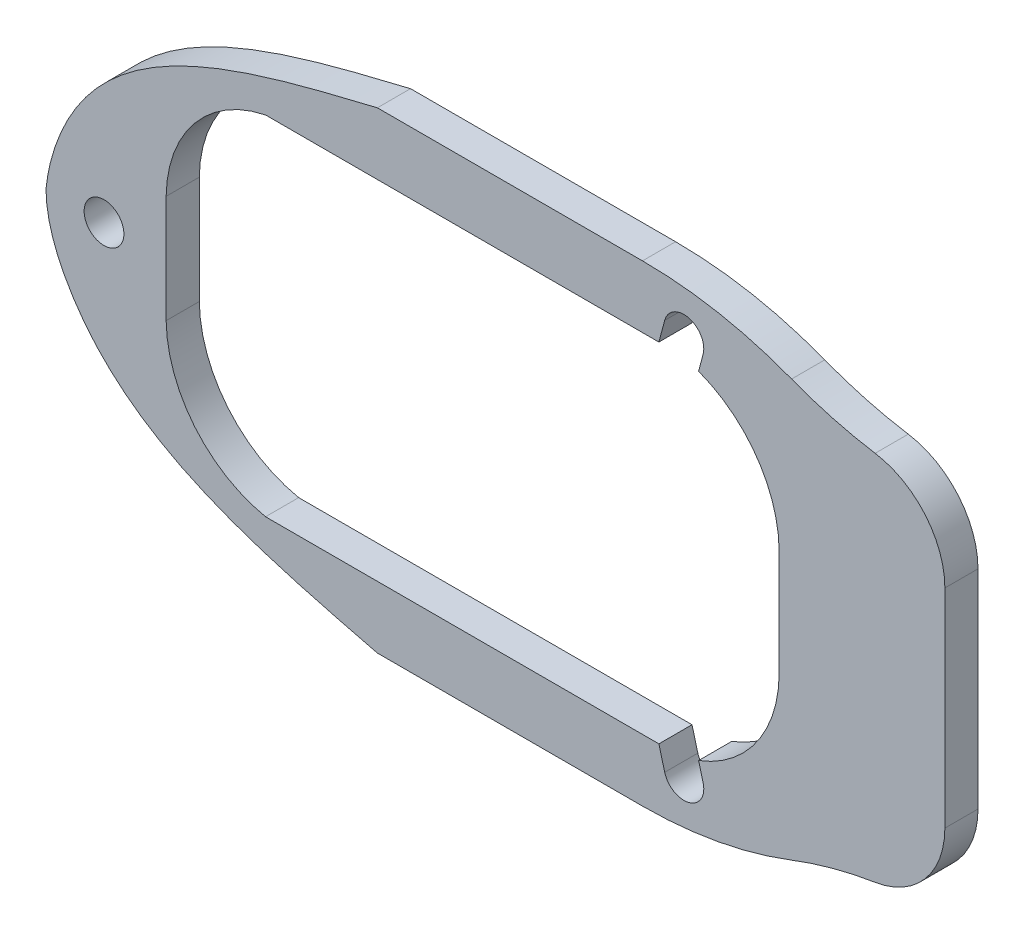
ISO-10303-21;
HEADER;
FILE_DESCRIPTION(('STEP AP214'),'2;1');
FILE_NAME('part.step','',(''),(''),'','','');
FILE_SCHEMA(('AUTOMOTIVE_DESIGN { 1 0 10303 214 1 1 1 1 }'));
ENDSEC;
DATA;
#1=APPLICATION_CONTEXT('core data for automotive mechanical design processes');
#2=APPLICATION_PROTOCOL_DEFINITION('international standard','automotive_design',2000,#1);
#3=PRODUCT_CONTEXT('',#1,'mechanical');
#4=PRODUCT('Part','Part','',(#3));
#5=PRODUCT_RELATED_PRODUCT_CATEGORY('part','',(#4));
#6=PRODUCT_DEFINITION_FORMATION('','',#4);
#7=PRODUCT_DEFINITION_CONTEXT('part definition',#1,'design');
#8=PRODUCT_DEFINITION('design','',#6,#7);
#9=PRODUCT_DEFINITION_SHAPE('','',#8);
#10=(LENGTH_UNIT() NAMED_UNIT(*) SI_UNIT(.MILLI.,.METRE.));
#11=(NAMED_UNIT(*) PLANE_ANGLE_UNIT() SI_UNIT($,.RADIAN.));
#12=(NAMED_UNIT(*) SI_UNIT($,.STERADIAN.) SOLID_ANGLE_UNIT());
#13=UNCERTAINTY_MEASURE_WITH_UNIT(LENGTH_MEASURE(1.E-05),#10,'distance_accuracy_value','');
#14=(GEOMETRIC_REPRESENTATION_CONTEXT(3) GLOBAL_UNCERTAINTY_ASSIGNED_CONTEXT((#13)) GLOBAL_UNIT_ASSIGNED_CONTEXT((#10,
#11,#12)) REPRESENTATION_CONTEXT('',''));
#15=CARTESIAN_POINT('',(0.,0.,0.));
#16=DIRECTION('',(0.,0.,1.));
#17=DIRECTION('',(1.,0.,0.));
#18=AXIS2_PLACEMENT_3D('',#15,#16,#17);
#19=CARTESIAN_POINT('',(-144.867623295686,20.0849650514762,2.));
#20=DIRECTION('',(0.,0.,-1.));
#21=DIRECTION('',(-1.,0.,0.));
#22=AXIS2_PLACEMENT_3D('',#19,#20,#21);
#23=PLANE('',#22);
#24=CARTESIAN_POINT('',(-144.867623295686,20.0849650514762,2.));
#25=DIRECTION('',(0.,0.,1.));
#26=DIRECTION('',(-1.,0.,0.));
#27=AXIS2_PLACEMENT_3D('',#24,#25,#26);
#28=CIRCLE('',#27,4.99999999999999);
#29=CARTESIAN_POINT('',(-144.075956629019,15.1480364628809,2.));
#30=VERTEX_POINT('',#29);
#31=CARTESIAN_POINT('',(-139.867623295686,20.0849650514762,2.));
#32=VERTEX_POINT('',#31);
#33=EDGE_CURVE('E330',#30,#32,#28,.T.);
#34=ORIENTED_EDGE('',*,*,#33,.T.);
#35=DIRECTION('',(0.,1.,0.));
#36=VECTOR('',#35,1.);
#37=CARTESIAN_POINT('',(-139.867623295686,32.6370523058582,2.));
#38=LINE('',#37,#36);
#39=CARTESIAN_POINT('',(-139.867623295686,32.6370523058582,2.));
#40=VERTEX_POINT('',#39);
#41=EDGE_CURVE('E333',#32,#40,#38,.T.);
#42=ORIENTED_EDGE('',*,*,#41,.T.);
#43=CARTESIAN_POINT('',(-144.867623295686,32.6370523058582,2.));
#44=DIRECTION('',(0.,0.,1.));
#45=DIRECTION('',(-1.,0.,0.));
#46=AXIS2_PLACEMENT_3D('',#43,#44,#45);
#47=CIRCLE('',#46,5.);
#48=CARTESIAN_POINT('',(-144.075956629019,37.5739808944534,2.));
#49=VERTEX_POINT('',#48);
#50=EDGE_CURVE('E335',#40,#49,#47,.T.);
#51=ORIENTED_EDGE('',*,*,#50,.T.);
#52=CARTESIAN_POINT('',(-140.117623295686,62.2586238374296,2.));
#53=DIRECTION('',(0.,0.,-1.));
#54=DIRECTION('',(-1.,0.,0.));
#55=AXIS2_PLACEMENT_3D('',#52,#53,#54);
#56=CIRCLE('',#55,25.);
#57=CARTESIAN_POINT('',(-149.117623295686,38.9348162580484,2.));
#58=VERTEX_POINT('',#57);
#59=EDGE_CURVE('E337',#49,#58,#56,.T.);
#60=ORIENTED_EDGE('',*,*,#59,.T.);
#61=CARTESIAN_POINT('',(-158.117623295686,15.6110086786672,2.));
#62=DIRECTION('',(0.,0.,1.));
#63=DIRECTION('',(1.,0.,0.));
#64=AXIS2_PLACEMENT_3D('',#61,#62,#63);
#65=CIRCLE('',#64,25.);
#66=CARTESIAN_POINT('',(-158.117623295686,40.6110086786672,2.));
#67=VERTEX_POINT('',#66);
#68=EDGE_CURVE('E339',#58,#67,#65,.T.);
#69=ORIENTED_EDGE('',*,*,#68,.T.);
#70=DIRECTION('',(-1.,0.,0.));
#71=VECTOR('',#70,1.);
#72=CARTESIAN_POINT('',(-174.117623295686,40.6110086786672,2.));
#73=LINE('',#72,#71);
#74=CARTESIAN_POINT('',(-174.117623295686,40.6110086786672,2.));
#75=VERTEX_POINT('',#74);
#76=EDGE_CURVE('E341',#67,#75,#73,.T.);
#77=ORIENTED_EDGE('',*,*,#76,.T.);
#78=CARTESIAN_POINT('',(-174.117623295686,40.6110086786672,2.));
#79=CARTESIAN_POINT('',(-181.722465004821,38.7717142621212,2.));
#80=CARTESIAN_POINT('',(-191.065836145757,36.5119419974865,2.));
#81=CARTESIAN_POINT('',(-193.959232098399,27.9475153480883,2.));
#82=CARTESIAN_POINT('',(-194.117623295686,26.3610086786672,2.));
#83=B_SPLINE_CURVE_WITH_KNOTS('',3,(#78,#79,#80,#81,#82),.UNSPECIFIED.,.F.,.F.,(4,1,4),(0.,
0.813929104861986,1.),.UNSPECIFIED.);
#84=CARTESIAN_POINT('',(-194.117623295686,26.3610086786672,2.));
#85=VERTEX_POINT('',#84);
#86=EDGE_CURVE('E343',#75,#85,#83,.T.);
#87=ORIENTED_EDGE('',*,*,#86,.T.);
#88=CARTESIAN_POINT('',(-194.117623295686,26.3610086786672,2.));
#89=CARTESIAN_POINT('',(-194.117623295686,24.7666150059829,2.));
#90=CARTESIAN_POINT('',(-190.736312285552,16.2264838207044,2.));
#91=CARTESIAN_POINT('',(-181.574604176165,13.9576657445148,2.));
#92=CARTESIAN_POINT('',(-174.117623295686,12.1110086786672,2.));
#93=B_SPLINE_CURVE_WITH_KNOTS('',3,(#88,#89,#90,#91,#92),.UNSPECIFIED.,.F.,.F.,(4,1,4),(0.,
0.186070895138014,1.),.UNSPECIFIED.);
#94=CARTESIAN_POINT('',(-174.117623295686,12.1110086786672,2.));
#95=VERTEX_POINT('',#94);
#96=EDGE_CURVE('E348',#85,#95,#93,.T.);
#97=ORIENTED_EDGE('',*,*,#96,.T.);
#98=DIRECTION('',(1.,0.,0.));
#99=VECTOR('',#98,1.);
#100=CARTESIAN_POINT('',(-174.117623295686,12.1110086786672,2.));
#101=LINE('',#100,#99);
#102=CARTESIAN_POINT('',(-158.117623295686,12.1110086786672,2.));
#103=VERTEX_POINT('',#102);
#104=EDGE_CURVE('E589',#95,#103,#101,.T.);
#105=ORIENTED_EDGE('',*,*,#104,.T.);
#106=CARTESIAN_POINT('',(-158.117623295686,37.1110086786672,2.));
#107=DIRECTION('',(0.,0.,1.));
#108=DIRECTION('',(-1.,0.,0.));
#109=AXIS2_PLACEMENT_3D('',#106,#107,#108);
#110=CIRCLE('',#109,25.);
#111=CARTESIAN_POINT('',(-149.117623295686,13.787201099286,2.));
#112=VERTEX_POINT('',#111);
#113=EDGE_CURVE('E428',#103,#112,#110,.T.);
#114=ORIENTED_EDGE('',*,*,#113,.T.);
#115=CARTESIAN_POINT('',(-140.117623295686,-9.53660648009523,2.));
#116=DIRECTION('',(0.,0.,-1.));
#117=DIRECTION('',(1.,0.,0.));
#118=AXIS2_PLACEMENT_3D('',#115,#116,#117);
#119=CIRCLE('',#118,25.);
#120=EDGE_CURVE('E440',#112,#30,#119,.T.);
#121=ORIENTED_EDGE('',*,*,#120,.T.);
#122=EDGE_LOOP('',(#34,#42,#51,#60,#69,#77,#87,#97,#105,#114,#121));
#123=FACE_BOUND('',#122,.T.);
#124=CARTESIAN_POINT('',(-190.617623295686,26.3610086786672,2.));
#125=DIRECTION('',(0.,0.,1.));
#126=DIRECTION('',(1.,0.,0.));
#127=AXIS2_PLACEMENT_3D('',#124,#125,#126);
#128=CIRCLE('',#127,1.20000000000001);
#129=CARTESIAN_POINT('',(-189.417623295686,26.3610086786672,2.));
#130=VERTEX_POINT('',#129);
#131=EDGE_CURVE('E239',#130,#130,#128,.T.);
#132=ORIENTED_EDGE('',*,*,#131,.F.);
#133=EDGE_LOOP('',(#132));
#134=FACE_BOUND('',#133,.T.);
#135=DIRECTION('',(0.258819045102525,-0.965925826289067,0.));
#136=VECTOR('',#135,1.);
#137=CARTESIAN_POINT('',(-156.776734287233,14.5504258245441,2.));
#138=LINE('',#137,#136);
#139=CARTESIAN_POINT('',(-157.127903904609,15.8610086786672,2.));
#140=VERTEX_POINT('',#139);
#141=CARTESIAN_POINT('',(-156.776734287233,14.5504258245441,2.));
#142=VERTEX_POINT('',#141);
#143=EDGE_CURVE('E202',#140,#142,#138,.T.);
#144=ORIENTED_EDGE('',*,*,#143,.F.);
#145=DIRECTION('',(1.,0.,0.));
#146=VECTOR('',#145,1.);
#147=CARTESIAN_POINT('',(-180.866976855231,15.8610086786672,2.));
#148=LINE('',#147,#146);
#149=CARTESIAN_POINT('',(-180.866976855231,15.8610086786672,2.));
#150=VERTEX_POINT('',#149);
#151=EDGE_CURVE('E244',#150,#140,#148,.T.);
#152=ORIENTED_EDGE('',*,*,#151,.F.);
#153=CARTESIAN_POINT('',(-179.366976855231,23.2094779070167,2.));
#154=DIRECTION('',(0.,0.,1.));
#155=DIRECTION('',(1.,0.,0.));
#156=AXIS2_PLACEMENT_3D('',#153,#154,#155);
#157=CIRCLE('',#156,7.50000000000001);
#158=CARTESIAN_POINT('',(-186.866330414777,23.1110086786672,2.));
#159=VERTEX_POINT('',#158);
#160=EDGE_CURVE('E242',#159,#150,#157,.T.);
#161=ORIENTED_EDGE('',*,*,#160,.F.);
#162=DIRECTION('',(0.,-1.,0.));
#163=VECTOR('',#162,1.);
#164=CARTESIAN_POINT('',(-186.866330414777,29.6110086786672,2.));
#165=LINE('',#164,#163);
#166=CARTESIAN_POINT('',(-186.866330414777,29.6110086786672,2.));
#167=VERTEX_POINT('',#166);
#168=EDGE_CURVE('E260',#167,#159,#165,.T.);
#169=ORIENTED_EDGE('',*,*,#168,.F.);
#170=CARTESIAN_POINT('',(-179.366976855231,29.5125394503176,2.));
#171=DIRECTION('',(0.,0.,1.));
#172=DIRECTION('',(-1.,0.,0.));
#173=AXIS2_PLACEMENT_3D('',#170,#171,#172);
#174=CIRCLE('',#173,7.50000000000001);
#175=CARTESIAN_POINT('',(-180.866976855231,36.8610086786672,2.));
#176=VERTEX_POINT('',#175);
#177=EDGE_CURVE('E257',#176,#167,#174,.T.);
#178=ORIENTED_EDGE('',*,*,#177,.F.);
#179=DIRECTION('',(-1.,0.,0.));
#180=VECTOR('',#179,1.);
#181=CARTESIAN_POINT('',(-180.866976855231,36.8610086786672,2.));
#182=LINE('',#181,#180);
#183=CARTESIAN_POINT('',(-157.127903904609,36.8610086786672,2.));
#184=VERTEX_POINT('',#183);
#185=EDGE_CURVE('E255',#184,#176,#182,.T.);
#186=ORIENTED_EDGE('',*,*,#185,.F.);
#187=DIRECTION('',(-0.258819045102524,-0.965925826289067,0.));
#188=VECTOR('',#187,1.);
#189=CARTESIAN_POINT('',(-156.776734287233,38.1715915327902,2.));
#190=LINE('',#189,#188);
#191=CARTESIAN_POINT('',(-156.776734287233,38.1715915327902,2.));
#192=VERTEX_POINT('',#191);
#193=EDGE_CURVE('E227',#192,#184,#190,.T.);
#194=ORIENTED_EDGE('',*,*,#193,.F.);
#195=CARTESIAN_POINT('',(-155.617623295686,37.8610086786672,2.));
#196=DIRECTION('',(0.,0.,1.));
#197=DIRECTION('',(1.,0.,0.));
#198=AXIS2_PLACEMENT_3D('',#195,#196,#197);
#199=CIRCLE('',#198,1.20000000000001);
#200=CARTESIAN_POINT('',(-154.458512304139,37.5504258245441,2.));
#201=VERTEX_POINT('',#200);
#202=EDGE_CURVE('E225',#201,#192,#199,.T.);
#203=ORIENTED_EDGE('',*,*,#202,.F.);
#204=DIRECTION('',(0.258819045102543,0.965925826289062,0.));
#205=VECTOR('',#204,1.);
#206=CARTESIAN_POINT('',(-155.269987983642,34.5219573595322,2.));
#207=LINE('',#206,#205);
#208=CARTESIAN_POINT('',(-154.730862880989,36.5339996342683,2.));
#209=VERTEX_POINT('',#208);
#210=EDGE_CURVE('E229',#209,#201,#207,.T.);
#211=ORIENTED_EDGE('',*,*,#210,.F.);
#212=CARTESIAN_POINT('',(-157.366976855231,29.5125394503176,2.));
#213=DIRECTION('',(0.,0.,1.));
#214=DIRECTION('',(-1.,0.,0.));
#215=AXIS2_PLACEMENT_3D('',#212,#213,#214);
#216=CIRCLE('',#215,7.5);
#217=CARTESIAN_POINT('',(-149.867623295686,29.6110086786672,2.));
#218=VERTEX_POINT('',#217);
#219=EDGE_CURVE('E252',#218,#209,#216,.T.);
#220=ORIENTED_EDGE('',*,*,#219,.F.);
#221=DIRECTION('',(0.,1.,0.));
#222=VECTOR('',#221,1.);
#223=CARTESIAN_POINT('',(-149.867623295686,29.6110086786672,2.));
#224=LINE('',#223,#222);
#225=CARTESIAN_POINT('',(-149.867623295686,23.1110086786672,2.));
#226=VERTEX_POINT('',#225);
#227=EDGE_CURVE('E249',#226,#218,#224,.T.);
#228=ORIENTED_EDGE('',*,*,#227,.F.);
#229=CARTESIAN_POINT('',(-157.366976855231,23.2094779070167,2.));
#230=DIRECTION('',(0.,0.,1.));
#231=DIRECTION('',(1.,0.,0.));
#232=AXIS2_PLACEMENT_3D('',#229,#230,#231);
#233=CIRCLE('',#232,7.5);
#234=CARTESIAN_POINT('',(-154.730862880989,16.188017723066,2.));
#235=VERTEX_POINT('',#234);
#236=EDGE_CURVE('E247',#235,#226,#233,.T.);
#237=ORIENTED_EDGE('',*,*,#236,.F.);
#238=DIRECTION('',(-0.258819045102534,0.965925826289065,0.));
#239=VECTOR('',#238,1.);
#240=CARTESIAN_POINT('',(-155.269987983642,18.2000599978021,2.));
#241=LINE('',#240,#239);
#242=CARTESIAN_POINT('',(-154.458512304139,15.1715915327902,2.));
#243=VERTEX_POINT('',#242);
#244=EDGE_CURVE('E216',#243,#235,#241,.T.);
#245=ORIENTED_EDGE('',*,*,#244,.F.);
#246=CARTESIAN_POINT('',(-155.617623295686,14.8610086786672,2.));
#247=DIRECTION('',(0.,0.,1.));
#248=DIRECTION('',(-1.,0.,0.));
#249=AXIS2_PLACEMENT_3D('',#246,#247,#248);
#250=CIRCLE('',#249,1.2);
#251=EDGE_CURVE('E214',#142,#243,#250,.T.);
#252=ORIENTED_EDGE('',*,*,#251,.F.);
#253=EDGE_LOOP('',(#144,#152,#161,#169,#178,#186,#194,#203,#211,#220,#228,#237,#245,#252));
#254=FACE_BOUND('',#253,.T.);
#255=ADVANCED_FACE('F22',(#123,#134,#254),#23,.F.);
#256=CARTESIAN_POINT('',(-144.867623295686,20.0849650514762,0.));
#257=DIRECTION('',(0.,0.,-1.));
#258=DIRECTION('',(-1.,0.,0.));
#259=AXIS2_PLACEMENT_3D('',#256,#257,#258);
#260=PLANE('',#259);
#261=CARTESIAN_POINT('',(-144.867623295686,20.0849650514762,0.));
#262=DIRECTION('',(0.,0.,1.));
#263=DIRECTION('',(-1.,0.,0.));
#264=AXIS2_PLACEMENT_3D('',#261,#262,#263);
#265=CIRCLE('',#264,4.99999999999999);
#266=CARTESIAN_POINT('',(-144.075956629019,15.1480364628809,0.));
#267=VERTEX_POINT('',#266);
#268=CARTESIAN_POINT('',(-139.867623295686,20.0849650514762,0.));
#269=VERTEX_POINT('',#268);
#270=EDGE_CURVE('E285',#267,#269,#265,.T.);
#271=ORIENTED_EDGE('',*,*,#270,.F.);
#272=CARTESIAN_POINT('',(-140.117623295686,-9.53660648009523,0.));
#273=DIRECTION('',(0.,0.,-1.));
#274=DIRECTION('',(1.,0.,0.));
#275=AXIS2_PLACEMENT_3D('',#272,#273,#274);
#276=CIRCLE('',#275,25.);
#277=CARTESIAN_POINT('',(-149.117623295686,13.787201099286,0.));
#278=VERTEX_POINT('',#277);
#279=EDGE_CURVE('E328',#278,#267,#276,.T.);
#280=ORIENTED_EDGE('',*,*,#279,.F.);
#281=CARTESIAN_POINT('',(-158.117623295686,37.1110086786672,0.));
#282=DIRECTION('',(0.,0.,1.));
#283=DIRECTION('',(-1.,0.,0.));
#284=AXIS2_PLACEMENT_3D('',#281,#282,#283);
#285=CIRCLE('',#284,25.);
#286=CARTESIAN_POINT('',(-158.117623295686,12.1110086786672,0.));
#287=VERTEX_POINT('',#286);
#288=EDGE_CURVE('E326',#287,#278,#285,.T.);
#289=ORIENTED_EDGE('',*,*,#288,.F.);
#290=DIRECTION('',(1.,0.,0.));
#291=VECTOR('',#290,1.);
#292=CARTESIAN_POINT('',(-174.117623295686,12.1110086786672,0.));
#293=LINE('',#292,#291);
#294=CARTESIAN_POINT('',(-174.117623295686,12.1110086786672,0.));
#295=VERTEX_POINT('',#294);
#296=EDGE_CURVE('E321',#295,#287,#293,.T.);
#297=ORIENTED_EDGE('',*,*,#296,.F.);
#298=CARTESIAN_POINT('',(-194.117623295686,26.3610086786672,0.));
#299=CARTESIAN_POINT('',(-194.117623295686,24.7666150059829,0.));
#300=CARTESIAN_POINT('',(-190.736312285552,16.2264838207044,0.));
#301=CARTESIAN_POINT('',(-181.574604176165,13.9576657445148,0.));
#302=CARTESIAN_POINT('',(-174.117623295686,12.1110086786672,0.));
#303=B_SPLINE_CURVE_WITH_KNOTS('',3,(#298,#299,#300,#301,#302),.UNSPECIFIED.,.F.,.F.,(4,1,4),
(0.,0.186070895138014,1.),.UNSPECIFIED.);
#304=CARTESIAN_POINT('',(-194.117623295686,26.3610086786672,0.));
#305=VERTEX_POINT('',#304);
#306=EDGE_CURVE('E314',#305,#295,#303,.T.);
#307=ORIENTED_EDGE('',*,*,#306,.F.);
#308=CARTESIAN_POINT('',(-174.117623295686,40.6110086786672,0.));
#309=CARTESIAN_POINT('',(-181.722465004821,38.7717142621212,0.));
#310=CARTESIAN_POINT('',(-191.065836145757,36.5119419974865,0.));
#311=CARTESIAN_POINT('',(-193.959232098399,27.9475153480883,0.));
#312=CARTESIAN_POINT('',(-194.117623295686,26.3610086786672,0.));
#313=B_SPLINE_CURVE_WITH_KNOTS('',3,(#308,#309,#310,#311,#312),.UNSPECIFIED.,.F.,.F.,(4,1,4),
(0.,0.813929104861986,1.),.UNSPECIFIED.);
#314=CARTESIAN_POINT('',(-174.117623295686,40.6110086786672,0.));
#315=VERTEX_POINT('',#314);
#316=EDGE_CURVE('E310',#315,#305,#313,.T.);
#317=ORIENTED_EDGE('',*,*,#316,.F.);
#318=DIRECTION('',(-1.,0.,0.));
#319=VECTOR('',#318,1.);
#320=CARTESIAN_POINT('',(-174.117623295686,40.6110086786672,0.));
#321=LINE('',#320,#319);
#322=CARTESIAN_POINT('',(-158.117623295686,40.6110086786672,0.));
#323=VERTEX_POINT('',#322);
#324=EDGE_CURVE('E308',#323,#315,#321,.T.);
#325=ORIENTED_EDGE('',*,*,#324,.F.);
#326=CARTESIAN_POINT('',(-158.117623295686,15.6110086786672,0.));
#327=DIRECTION('',(0.,0.,1.));
#328=DIRECTION('',(1.,0.,0.));
#329=AXIS2_PLACEMENT_3D('',#326,#327,#328);
#330=CIRCLE('',#329,25.);
#331=CARTESIAN_POINT('',(-149.117623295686,38.9348162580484,0.));
#332=VERTEX_POINT('',#331);
#333=EDGE_CURVE('E306',#332,#323,#330,.T.);
#334=ORIENTED_EDGE('',*,*,#333,.F.);
#335=CARTESIAN_POINT('',(-140.117623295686,62.2586238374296,0.));
#336=DIRECTION('',(0.,0.,-1.));
#337=DIRECTION('',(-1.,0.,0.));
#338=AXIS2_PLACEMENT_3D('',#335,#336,#337);
#339=CIRCLE('',#338,25.);
#340=CARTESIAN_POINT('',(-144.075956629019,37.5739808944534,0.));
#341=VERTEX_POINT('',#340);
#342=EDGE_CURVE('E304',#341,#332,#339,.T.);
#343=ORIENTED_EDGE('',*,*,#342,.F.);
#344=CARTESIAN_POINT('',(-144.867623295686,32.6370523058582,0.));
#345=DIRECTION('',(0.,0.,1.));
#346=DIRECTION('',(-1.,0.,0.));
#347=AXIS2_PLACEMENT_3D('',#344,#345,#346);
#348=CIRCLE('',#347,5.);
#349=CARTESIAN_POINT('',(-139.867623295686,32.6370523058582,0.));
#350=VERTEX_POINT('',#349);
#351=EDGE_CURVE('E302',#350,#341,#348,.T.);
#352=ORIENTED_EDGE('',*,*,#351,.F.);
#353=DIRECTION('',(0.,1.,0.));
#354=VECTOR('',#353,1.);
#355=CARTESIAN_POINT('',(-139.867623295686,32.6370523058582,0.));
#356=LINE('',#355,#354);
#357=EDGE_CURVE('E300',#269,#350,#356,.T.);
#358=ORIENTED_EDGE('',*,*,#357,.F.);
#359=EDGE_LOOP('',(#271,#280,#289,#297,#307,#317,#325,#334,#343,#352,#358));
#360=FACE_BOUND('',#359,.T.);
#361=CARTESIAN_POINT('',(-190.617623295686,26.3610086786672,0.));
#362=DIRECTION('',(0.,0.,1.));
#363=DIRECTION('',(1.,0.,0.));
#364=AXIS2_PLACEMENT_3D('',#361,#362,#363);
#365=CIRCLE('',#364,1.20000000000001);
#366=CARTESIAN_POINT('',(-189.417623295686,26.3610086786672,0.));
#367=VERTEX_POINT('',#366);
#368=EDGE_CURVE('E236',#367,#367,#365,.T.);
#369=ORIENTED_EDGE('',*,*,#368,.T.);
#370=EDGE_LOOP('',(#369));
#371=FACE_BOUND('',#370,.T.);
#372=DIRECTION('',(1.,0.,0.));
#373=VECTOR('',#372,1.);
#374=CARTESIAN_POINT('',(-180.866976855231,15.8610086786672,0.));
#375=LINE('',#374,#373);
#376=CARTESIAN_POINT('',(-180.866976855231,15.8610086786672,0.));
#377=VERTEX_POINT('',#376);
#378=CARTESIAN_POINT('',(-157.127903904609,15.8610086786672,0.));
#379=VERTEX_POINT('',#378);
#380=EDGE_CURVE('E209',#377,#379,#375,.T.);
#381=ORIENTED_EDGE('',*,*,#380,.T.);
#382=DIRECTION('',(0.258819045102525,-0.965925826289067,0.));
#383=VECTOR('',#382,1.);
#384=CARTESIAN_POINT('',(-156.776734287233,14.5504258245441,0.));
#385=LINE('',#384,#383);
#386=CARTESIAN_POINT('',(-156.776734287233,14.5504258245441,0.));
#387=VERTEX_POINT('',#386);
#388=EDGE_CURVE('E37',#379,#387,#385,.T.);
#389=ORIENTED_EDGE('',*,*,#388,.T.);
#390=CARTESIAN_POINT('',(-155.617623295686,14.8610086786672,0.));
#391=DIRECTION('',(0.,0.,1.));
#392=DIRECTION('',(-1.,0.,0.));
#393=AXIS2_PLACEMENT_3D('',#390,#391,#392);
#394=CIRCLE('',#393,1.2);
#395=CARTESIAN_POINT('',(-154.458512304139,15.1715915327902,0.));
#396=VERTEX_POINT('',#395);
#397=EDGE_CURVE('E189',#387,#396,#394,.T.);
#398=ORIENTED_EDGE('',*,*,#397,.T.);
#399=DIRECTION('',(-0.258819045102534,0.965925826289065,0.));
#400=VECTOR('',#399,1.);
#401=CARTESIAN_POINT('',(-155.269987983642,18.2000599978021,0.));
#402=LINE('',#401,#400);
#403=CARTESIAN_POINT('',(-154.730862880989,16.188017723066,0.));
#404=VERTEX_POINT('',#403);
#405=EDGE_CURVE('E198',#396,#404,#402,.T.);
#406=ORIENTED_EDGE('',*,*,#405,.T.);
#407=CARTESIAN_POINT('',(-157.366976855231,23.2094779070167,0.));
#408=DIRECTION('',(0.,0.,1.));
#409=DIRECTION('',(1.,0.,0.));
#410=AXIS2_PLACEMENT_3D('',#407,#408,#409);
#411=CIRCLE('',#410,7.5);
#412=CARTESIAN_POINT('',(-149.867623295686,23.1110086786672,0.));
#413=VERTEX_POINT('',#412);
#414=EDGE_CURVE('E266',#404,#413,#411,.T.);
#415=ORIENTED_EDGE('',*,*,#414,.T.);
#416=DIRECTION('',(0.,1.,0.));
#417=VECTOR('',#416,1.);
#418=CARTESIAN_POINT('',(-149.867623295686,29.6110086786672,0.));
#419=LINE('',#418,#417);
#420=CARTESIAN_POINT('',(-149.867623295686,29.6110086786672,0.));
#421=VERTEX_POINT('',#420);
#422=EDGE_CURVE('E268',#413,#421,#419,.T.);
#423=ORIENTED_EDGE('',*,*,#422,.T.);
#424=CARTESIAN_POINT('',(-157.366976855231,29.5125394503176,0.));
#425=DIRECTION('',(0.,0.,1.));
#426=DIRECTION('',(-1.,0.,0.));
#427=AXIS2_PLACEMENT_3D('',#424,#425,#426);
#428=CIRCLE('',#427,7.5);
#429=CARTESIAN_POINT('',(-154.730862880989,36.5339996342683,0.));
#430=VERTEX_POINT('',#429);
#431=EDGE_CURVE('E271',#421,#430,#428,.T.);
#432=ORIENTED_EDGE('',*,*,#431,.T.);
#433=DIRECTION('',(0.258819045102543,0.965925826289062,0.));
#434=VECTOR('',#433,1.);
#435=CARTESIAN_POINT('',(-155.269987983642,34.5219573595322,0.));
#436=LINE('',#435,#434);
#437=CARTESIAN_POINT('',(-154.458512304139,37.5504258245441,0.));
#438=VERTEX_POINT('',#437);
#439=EDGE_CURVE('E45',#430,#438,#436,.T.);
#440=ORIENTED_EDGE('',*,*,#439,.T.);
#441=CARTESIAN_POINT('',(-155.617623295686,37.8610086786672,0.));
#442=DIRECTION('',(0.,0.,1.));
#443=DIRECTION('',(1.,0.,0.));
#444=AXIS2_PLACEMENT_3D('',#441,#442,#443);
#445=CIRCLE('',#444,1.20000000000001);
#446=CARTESIAN_POINT('',(-156.776734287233,38.1715915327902,0.));
#447=VERTEX_POINT('',#446);
#448=EDGE_CURVE('E203',#438,#447,#445,.T.);
#449=ORIENTED_EDGE('',*,*,#448,.T.);
#450=DIRECTION('',(-0.258819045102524,-0.965925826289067,0.));
#451=VECTOR('',#450,1.);
#452=CARTESIAN_POINT('',(-156.776734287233,38.1715915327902,0.));
#453=LINE('',#452,#451);
#454=CARTESIAN_POINT('',(-157.127903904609,36.8610086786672,0.));
#455=VERTEX_POINT('',#454);
#456=EDGE_CURVE('E221',#447,#455,#453,.T.);
#457=ORIENTED_EDGE('',*,*,#456,.T.);
#458=DIRECTION('',(-1.,0.,0.));
#459=VECTOR('',#458,1.);
#460=CARTESIAN_POINT('',(-180.866976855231,36.8610086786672,0.));
#461=LINE('',#460,#459);
#462=CARTESIAN_POINT('',(-180.866976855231,36.8610086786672,0.));
#463=VERTEX_POINT('',#462);
#464=EDGE_CURVE('E274',#455,#463,#461,.T.);
#465=ORIENTED_EDGE('',*,*,#464,.T.);
#466=CARTESIAN_POINT('',(-179.366976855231,29.5125394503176,0.));
#467=DIRECTION('',(0.,0.,1.));
#468=DIRECTION('',(-1.,0.,0.));
#469=AXIS2_PLACEMENT_3D('',#466,#467,#468);
#470=CIRCLE('',#469,7.50000000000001);
#471=CARTESIAN_POINT('',(-186.866330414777,29.6110086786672,0.));
#472=VERTEX_POINT('',#471);
#473=EDGE_CURVE('E276',#463,#472,#470,.T.);
#474=ORIENTED_EDGE('',*,*,#473,.T.);
#475=DIRECTION('',(0.,-1.,0.));
#476=VECTOR('',#475,1.);
#477=CARTESIAN_POINT('',(-186.866330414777,29.6110086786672,0.));
#478=LINE('',#477,#476);
#479=CARTESIAN_POINT('',(-186.866330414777,23.1110086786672,0.));
#480=VERTEX_POINT('',#479);
#481=EDGE_CURVE('E279',#472,#480,#478,.T.);
#482=ORIENTED_EDGE('',*,*,#481,.T.);
#483=CARTESIAN_POINT('',(-179.366976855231,23.2094779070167,0.));
#484=DIRECTION('',(0.,0.,1.));
#485=DIRECTION('',(1.,0.,0.));
#486=AXIS2_PLACEMENT_3D('',#483,#484,#485);
#487=CIRCLE('',#486,7.50000000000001);
#488=EDGE_CURVE('E263',#480,#377,#487,.T.);
#489=ORIENTED_EDGE('',*,*,#488,.T.);
#490=EDGE_LOOP('',(#381,#389,#398,#406,#415,#423,#432,#440,#449,#457,#465,#474,#482,#489));
#491=FACE_BOUND('',#490,.T.);
#492=ADVANCED_FACE('F206',(#360,#371,#491),#260,.T.);
#493=CARTESIAN_POINT('',(-157.366976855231,23.2094779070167,0.));
#494=DIRECTION('',(0.,0.,1.));
#495=DIRECTION('',(1.,0.,0.));
#496=AXIS2_PLACEMENT_3D('',#493,#494,#495);
#497=CYLINDRICAL_SURFACE('',#496,7.5);
#498=DIRECTION('',(0.,0.,1.));
#499=VECTOR('',#498,1.);
#500=CARTESIAN_POINT('',(-154.730862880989,16.188017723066,0.));
#501=LINE('',#500,#499);
#502=EDGE_CURVE('E11',#235,#404,#501,.F.);
#503=ORIENTED_EDGE('',*,*,#502,.F.);
#504=ORIENTED_EDGE('',*,*,#236,.T.);
#505=DIRECTION('',(0.,0.,1.));
#506=VECTOR('',#505,1.);
#507=CARTESIAN_POINT('',(-149.867623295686,23.1110086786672,0.));
#508=LINE('',#507,#506);
#509=EDGE_CURVE('E293',#413,#226,#508,.T.);
#510=ORIENTED_EDGE('',*,*,#509,.F.);
#511=ORIENTED_EDGE('',*,*,#414,.F.);
#512=EDGE_LOOP('',(#503,#504,#510,#511));
#513=FACE_BOUND('',#512,.T.);
#514=ADVANCED_FACE('F394',(#513),#497,.F.);
#515=CARTESIAN_POINT('',(-180.866976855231,15.8610086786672,0.));
#516=DIRECTION('',(0.,-1.,0.));
#517=DIRECTION('',(1.,0.,0.));
#518=AXIS2_PLACEMENT_3D('',#515,#516,#517);
#519=PLANE('',#518);
#520=DIRECTION('',(0.,0.,1.));
#521=VECTOR('',#520,1.);
#522=CARTESIAN_POINT('',(-157.127903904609,15.8610086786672,0.));
#523=LINE('',#522,#521);
#524=EDGE_CURVE('E30',#379,#140,#523,.T.);
#525=ORIENTED_EDGE('',*,*,#524,.F.);
#526=ORIENTED_EDGE('',*,*,#380,.F.);
#527=DIRECTION('',(0.,0.,1.));
#528=VECTOR('',#527,1.);
#529=CARTESIAN_POINT('',(-180.866976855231,15.8610086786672,0.));
#530=LINE('',#529,#528);
#531=EDGE_CURVE('E282',#377,#150,#530,.T.);
#532=ORIENTED_EDGE('',*,*,#531,.T.);
#533=ORIENTED_EDGE('',*,*,#151,.T.);
#534=EDGE_LOOP('',(#525,#526,#532,#533));
#535=FACE_BOUND('',#534,.T.);
#536=ADVANCED_FACE('F476',(#535),#519,.F.);
#537=CARTESIAN_POINT('',(-180.866976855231,36.8610086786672,0.));
#538=DIRECTION('',(0.,1.,0.));
#539=DIRECTION('',(-1.,0.,0.));
#540=AXIS2_PLACEMENT_3D('',#537,#538,#539);
#541=PLANE('',#540);
#542=DIRECTION('',(0.,0.,-1.));
#543=VECTOR('',#542,1.);
#544=CARTESIAN_POINT('',(-157.127903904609,36.8610086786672,0.));
#545=LINE('',#544,#543);
#546=EDGE_CURVE('E470',#184,#455,#545,.T.);
#547=ORIENTED_EDGE('',*,*,#546,.F.);
#548=ORIENTED_EDGE('',*,*,#185,.T.);
#549=DIRECTION('',(0.,0.,1.));
#550=VECTOR('',#549,1.);
#551=CARTESIAN_POINT('',(-180.866976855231,36.8610086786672,0.));
#552=LINE('',#551,#550);
#553=EDGE_CURVE('E288',#463,#176,#552,.T.);
#554=ORIENTED_EDGE('',*,*,#553,.F.);
#555=ORIENTED_EDGE('',*,*,#464,.F.);
#556=EDGE_LOOP('',(#547,#548,#554,#555));
#557=FACE_BOUND('',#556,.T.);
#558=ADVANCED_FACE('F492',(#557),#541,.F.);
#559=CARTESIAN_POINT('',(-157.366976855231,29.5125394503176,0.));
#560=DIRECTION('',(0.,0.,1.));
#561=DIRECTION('',(1.,0.,0.));
#562=AXIS2_PLACEMENT_3D('',#559,#560,#561);
#563=CYLINDRICAL_SURFACE('',#562,7.5);
#564=DIRECTION('',(0.,0.,1.));
#565=VECTOR('',#564,1.);
#566=CARTESIAN_POINT('',(-154.730862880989,36.5339996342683,0.));
#567=LINE('',#566,#565);
#568=EDGE_CURVE('E468',#430,#209,#567,.T.);
#569=ORIENTED_EDGE('',*,*,#568,.F.);
#570=ORIENTED_EDGE('',*,*,#431,.F.);
#571=DIRECTION('',(0.,0.,1.));
#572=VECTOR('',#571,1.);
#573=CARTESIAN_POINT('',(-149.867623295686,29.6110086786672,0.));
#574=LINE('',#573,#572);
#575=EDGE_CURVE('E291',#421,#218,#574,.T.);
#576=ORIENTED_EDGE('',*,*,#575,.T.);
#577=ORIENTED_EDGE('',*,*,#219,.T.);
#578=EDGE_LOOP('',(#569,#570,#576,#577));
#579=FACE_BOUND('',#578,.T.);
#580=ADVANCED_FACE('F385',(#579),#563,.F.);
#581=CARTESIAN_POINT('',(-144.867623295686,20.0849650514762,2.));
#582=DIRECTION('',(0.,0.,-1.));
#583=DIRECTION('',(-1.,0.,0.));
#584=AXIS2_PLACEMENT_3D('',#581,#582,#583);
#585=CYLINDRICAL_SURFACE('',#584,4.99999999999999);
#586=ORIENTED_EDGE('',*,*,#270,.T.);
#587=DIRECTION('',(0.,0.,-1.));
#588=VECTOR('',#587,1.);
#589=CARTESIAN_POINT('',(-139.867623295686,20.0849650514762,2.));
#590=LINE('',#589,#588);
#591=EDGE_CURVE('E465',#32,#269,#590,.T.);
#592=ORIENTED_EDGE('',*,*,#591,.F.);
#593=ORIENTED_EDGE('',*,*,#33,.F.);
#594=DIRECTION('',(0.,0.,-1.));
#595=VECTOR('',#594,1.);
#596=CARTESIAN_POINT('',(-144.075956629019,15.1480364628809,2.));
#597=LINE('',#596,#595);
#598=EDGE_CURVE('E437',#30,#267,#597,.T.);
#599=ORIENTED_EDGE('',*,*,#598,.T.);
#600=EDGE_LOOP('',(#586,#592,#593,#599));
#601=FACE_BOUND('',#600,.T.);
#602=ADVANCED_FACE('F24',(#601),#585,.T.);
#603=CARTESIAN_POINT('',(-139.867623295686,32.6370523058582,2.));
#604=DIRECTION('',(-1.,0.,0.));
#605=DIRECTION('',(0.,-1.,0.));
#606=AXIS2_PLACEMENT_3D('',#603,#604,#605);
#607=PLANE('',#606);
#608=ORIENTED_EDGE('',*,*,#357,.T.);
#609=DIRECTION('',(0.,0.,-1.));
#610=VECTOR('',#609,1.);
#611=CARTESIAN_POINT('',(-139.867623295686,32.6370523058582,2.));
#612=LINE('',#611,#610);
#613=EDGE_CURVE('E462',#40,#350,#612,.T.);
#614=ORIENTED_EDGE('',*,*,#613,.F.);
#615=ORIENTED_EDGE('',*,*,#41,.F.);
#616=ORIENTED_EDGE('',*,*,#591,.T.);
#617=EDGE_LOOP('',(#608,#614,#615,#616));
#618=FACE_BOUND('',#617,.T.);
#619=ADVANCED_FACE('F378',(#618),#607,.F.);
#620=CARTESIAN_POINT('',(-144.867623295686,32.6370523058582,2.));
#621=DIRECTION('',(0.,0.,-1.));
#622=DIRECTION('',(-1.,0.,0.));
#623=AXIS2_PLACEMENT_3D('',#620,#621,#622);
#624=CYLINDRICAL_SURFACE('',#623,5.);
#625=ORIENTED_EDGE('',*,*,#351,.T.);
#626=DIRECTION('',(0.,0.,-1.));
#627=VECTOR('',#626,1.);
#628=CARTESIAN_POINT('',(-144.075956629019,37.5739808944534,2.));
#629=LINE('',#628,#627);
#630=EDGE_CURVE('E459',#49,#341,#629,.T.);
#631=ORIENTED_EDGE('',*,*,#630,.F.);
#632=ORIENTED_EDGE('',*,*,#50,.F.);
#633=ORIENTED_EDGE('',*,*,#613,.T.);
#634=EDGE_LOOP('',(#625,#631,#632,#633));
#635=FACE_BOUND('',#634,.T.);
#636=ADVANCED_FACE('F375',(#635),#624,.T.);
#637=CARTESIAN_POINT('',(-140.117623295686,62.2586238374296,2.));
#638=DIRECTION('',(0.,0.,-1.));
#639=DIRECTION('',(-1.,0.,0.));
#640=AXIS2_PLACEMENT_3D('',#637,#638,#639);
#641=CYLINDRICAL_SURFACE('',#640,25.);
#642=ORIENTED_EDGE('',*,*,#342,.T.);
#643=DIRECTION('',(0.,0.,-1.));
#644=VECTOR('',#643,1.);
#645=CARTESIAN_POINT('',(-149.117623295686,38.9348162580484,2.));
#646=LINE('',#645,#644);
#647=EDGE_CURVE('E456',#58,#332,#646,.T.);
#648=ORIENTED_EDGE('',*,*,#647,.F.);
#649=ORIENTED_EDGE('',*,*,#59,.F.);
#650=ORIENTED_EDGE('',*,*,#630,.T.);
#651=EDGE_LOOP('',(#642,#648,#649,#650));
#652=FACE_BOUND('',#651,.T.);
#653=ADVANCED_FACE('F371',(#652),#641,.F.);
#654=CARTESIAN_POINT('',(-158.117623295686,15.6110086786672,2.));
#655=DIRECTION('',(0.,0.,-1.));
#656=DIRECTION('',(-1.,0.,0.));
#657=AXIS2_PLACEMENT_3D('',#654,#655,#656);
#658=CYLINDRICAL_SURFACE('',#657,25.);
#659=ORIENTED_EDGE('',*,*,#333,.T.);
#660=DIRECTION('',(0.,0.,-1.));
#661=VECTOR('',#660,1.);
#662=CARTESIAN_POINT('',(-158.117623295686,40.6110086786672,2.));
#663=LINE('',#662,#661);
#664=EDGE_CURVE('E453',#67,#323,#663,.T.);
#665=ORIENTED_EDGE('',*,*,#664,.F.);
#666=ORIENTED_EDGE('',*,*,#68,.F.);
#667=ORIENTED_EDGE('',*,*,#647,.T.);
#668=EDGE_LOOP('',(#659,#665,#666,#667));
#669=FACE_BOUND('',#668,.T.);
#670=ADVANCED_FACE('F367',(#669),#658,.T.);
#671=CARTESIAN_POINT('',(-174.117623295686,40.6110086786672,2.));
#672=DIRECTION('',(0.,-1.,0.));
#673=DIRECTION('',(1.,0.,0.));
#674=AXIS2_PLACEMENT_3D('',#671,#672,#673);
#675=PLANE('',#674);
#676=ORIENTED_EDGE('',*,*,#324,.T.);
#677=DIRECTION('',(0.,0.,-1.));
#678=VECTOR('',#677,1.);
#679=CARTESIAN_POINT('',(-174.117623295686,40.6110086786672,2.));
#680=LINE('',#679,#678);
#681=EDGE_CURVE('E450',#75,#315,#680,.T.);
#682=ORIENTED_EDGE('',*,*,#681,.F.);
#683=ORIENTED_EDGE('',*,*,#76,.F.);
#684=ORIENTED_EDGE('',*,*,#664,.T.);
#685=EDGE_LOOP('',(#676,#682,#683,#684));
#686=FACE_BOUND('',#685,.T.);
#687=ADVANCED_FACE('F362',(#686),#675,.F.);
#688=DIRECTION('',(0.,0.,-1.));
#689=VECTOR('',#688,1.);
#690=SURFACE_OF_LINEAR_EXTRUSION('',#83,#689);
#691=ORIENTED_EDGE('',*,*,#316,.T.);
#692=DIRECTION('',(0.,0.,-1.));
#693=VECTOR('',#692,1.);
#694=CARTESIAN_POINT('',(-194.117623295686,26.3610086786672,2.));
#695=LINE('',#694,#693);
#696=EDGE_CURVE('E447',#85,#305,#695,.T.);
#697=ORIENTED_EDGE('',*,*,#696,.F.);
#698=ORIENTED_EDGE('',*,*,#86,.F.);
#699=ORIENTED_EDGE('',*,*,#681,.T.);
#700=EDGE_LOOP('',(#691,#697,#698,#699));
#701=FACE_BOUND('',#700,.T.);
#702=ADVANCED_FACE('F357',(#701),#690,.F.);
#703=DIRECTION('',(0.,0.,-1.));
#704=VECTOR('',#703,1.);
#705=SURFACE_OF_LINEAR_EXTRUSION('',#93,#704);
#706=ORIENTED_EDGE('',*,*,#306,.T.);
#707=DIRECTION('',(0.,0.,-1.));
#708=VECTOR('',#707,1.);
#709=CARTESIAN_POINT('',(-174.117623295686,12.1110086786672,2.));
#710=LINE('',#709,#708);
#711=EDGE_CURVE('E423',#95,#295,#710,.T.);
#712=ORIENTED_EDGE('',*,*,#711,.F.);
#713=ORIENTED_EDGE('',*,*,#96,.F.);
#714=ORIENTED_EDGE('',*,*,#696,.T.);
#715=EDGE_LOOP('',(#706,#712,#713,#714));
#716=FACE_BOUND('',#715,.T.);
#717=ADVANCED_FACE('F361',(#716),#705,.F.);
#718=CARTESIAN_POINT('',(-174.117623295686,12.1110086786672,2.));
#719=DIRECTION('',(0.,1.,0.));
#720=DIRECTION('',(-1.,0.,0.));
#721=AXIS2_PLACEMENT_3D('',#718,#719,#720);
#722=PLANE('',#721);
#723=ORIENTED_EDGE('',*,*,#296,.T.);
#724=DIRECTION('',(0.,0.,-1.));
#725=VECTOR('',#724,1.);
#726=CARTESIAN_POINT('',(-158.117623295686,12.1110086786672,2.));
#727=LINE('',#726,#725);
#728=EDGE_CURVE('E420',#103,#287,#727,.T.);
#729=ORIENTED_EDGE('',*,*,#728,.F.);
#730=ORIENTED_EDGE('',*,*,#104,.F.);
#731=ORIENTED_EDGE('',*,*,#711,.T.);
#732=EDGE_LOOP('',(#723,#729,#730,#731));
#733=FACE_BOUND('',#732,.T.);
#734=ADVANCED_FACE('F407',(#733),#722,.F.);
#735=CARTESIAN_POINT('',(-158.117623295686,37.1110086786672,2.));
#736=DIRECTION('',(0.,0.,-1.));
#737=DIRECTION('',(-1.,0.,0.));
#738=AXIS2_PLACEMENT_3D('',#735,#736,#737);
#739=CYLINDRICAL_SURFACE('',#738,25.);
#740=ORIENTED_EDGE('',*,*,#288,.T.);
#741=DIRECTION('',(0.,0.,-1.));
#742=VECTOR('',#741,1.);
#743=CARTESIAN_POINT('',(-149.117623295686,13.787201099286,2.));
#744=LINE('',#743,#742);
#745=EDGE_CURVE('E429',#112,#278,#744,.T.);
#746=ORIENTED_EDGE('',*,*,#745,.F.);
#747=ORIENTED_EDGE('',*,*,#113,.F.);
#748=ORIENTED_EDGE('',*,*,#728,.T.);
#749=EDGE_LOOP('',(#740,#746,#747,#748));
#750=FACE_BOUND('',#749,.T.);
#751=ADVANCED_FACE('F404',(#750),#739,.T.);
#752=CARTESIAN_POINT('',(-140.117623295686,-9.53660648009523,2.));
#753=DIRECTION('',(0.,0.,-1.));
#754=DIRECTION('',(-1.,0.,0.));
#755=AXIS2_PLACEMENT_3D('',#752,#753,#754);
#756=CYLINDRICAL_SURFACE('',#755,25.);
#757=ORIENTED_EDGE('',*,*,#279,.T.);
#758=ORIENTED_EDGE('',*,*,#598,.F.);
#759=ORIENTED_EDGE('',*,*,#120,.F.);
#760=ORIENTED_EDGE('',*,*,#745,.T.);
#761=EDGE_LOOP('',(#757,#758,#759,#760));
#762=FACE_BOUND('',#761,.T.);
#763=ADVANCED_FACE('F400',(#762),#756,.F.);
#764=CARTESIAN_POINT('',(-179.366976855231,23.2094779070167,0.));
#765=DIRECTION('',(0.,0.,1.));
#766=DIRECTION('',(1.,0.,0.));
#767=AXIS2_PLACEMENT_3D('',#764,#765,#766);
#768=CYLINDRICAL_SURFACE('',#767,7.50000000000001);
#769=ORIENTED_EDGE('',*,*,#160,.T.);
#770=ORIENTED_EDGE('',*,*,#531,.F.);
#771=ORIENTED_EDGE('',*,*,#488,.F.);
#772=DIRECTION('',(0.,0.,1.));
#773=VECTOR('',#772,1.);
#774=CARTESIAN_POINT('',(-186.866330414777,23.1110086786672,0.));
#775=LINE('',#774,#773);
#776=EDGE_CURVE('E283',#480,#159,#775,.T.);
#777=ORIENTED_EDGE('',*,*,#776,.T.);
#778=EDGE_LOOP('',(#769,#770,#771,#777));
#779=FACE_BOUND('',#778,.T.);
#780=ADVANCED_FACE('F403',(#779),#768,.F.);
#781=CARTESIAN_POINT('',(-186.866330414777,29.6110086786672,0.));
#782=DIRECTION('',(-1.,0.,0.));
#783=DIRECTION('',(0.,0.,1.));
#784=AXIS2_PLACEMENT_3D('',#781,#782,#783);
#785=PLANE('',#784);
#786=ORIENTED_EDGE('',*,*,#168,.T.);
#787=ORIENTED_EDGE('',*,*,#776,.F.);
#788=ORIENTED_EDGE('',*,*,#481,.F.);
#789=DIRECTION('',(0.,0.,1.));
#790=VECTOR('',#789,1.);
#791=CARTESIAN_POINT('',(-186.866330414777,29.6110086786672,0.));
#792=LINE('',#791,#790);
#793=EDGE_CURVE('E286',#472,#167,#792,.T.);
#794=ORIENTED_EDGE('',*,*,#793,.T.);
#795=EDGE_LOOP('',(#786,#787,#788,#794));
#796=FACE_BOUND('',#795,.T.);
#797=ADVANCED_FACE('F483',(#796),#785,.F.);
#798=CARTESIAN_POINT('',(-179.366976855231,29.5125394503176,0.));
#799=DIRECTION('',(0.,0.,1.));
#800=DIRECTION('',(1.,0.,0.));
#801=AXIS2_PLACEMENT_3D('',#798,#799,#800);
#802=CYLINDRICAL_SURFACE('',#801,7.50000000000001);
#803=ORIENTED_EDGE('',*,*,#177,.T.);
#804=ORIENTED_EDGE('',*,*,#793,.F.);
#805=ORIENTED_EDGE('',*,*,#473,.F.);
#806=ORIENTED_EDGE('',*,*,#553,.T.);
#807=EDGE_LOOP('',(#803,#804,#805,#806));
#808=FACE_BOUND('',#807,.T.);
#809=ADVANCED_FACE('F487',(#808),#802,.F.);
#810=CARTESIAN_POINT('',(-149.867623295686,29.6110086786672,0.));
#811=DIRECTION('',(1.,0.,0.));
#812=DIRECTION('',(0.,0.,-1.));
#813=AXIS2_PLACEMENT_3D('',#810,#811,#812);
#814=PLANE('',#813);
#815=ORIENTED_EDGE('',*,*,#227,.T.);
#816=ORIENTED_EDGE('',*,*,#575,.F.);
#817=ORIENTED_EDGE('',*,*,#422,.F.);
#818=ORIENTED_EDGE('',*,*,#509,.T.);
#819=EDGE_LOOP('',(#815,#816,#817,#818));
#820=FACE_BOUND('',#819,.T.);
#821=ADVANCED_FACE('F511',(#820),#814,.F.);
#822=CARTESIAN_POINT('',(-190.617623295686,26.3610086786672,2.));
#823=DIRECTION('',(0.,0.,-1.));
#824=DIRECTION('',(-1.,0.,0.));
#825=AXIS2_PLACEMENT_3D('',#822,#823,#824);
#826=CYLINDRICAL_SURFACE('',#825,1.20000000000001);
#827=ORIENTED_EDGE('',*,*,#131,.T.);
#828=EDGE_LOOP('',(#827));
#829=FACE_BOUND('',#828,.T.);
#830=ORIENTED_EDGE('',*,*,#368,.F.);
#831=EDGE_LOOP('',(#830));
#832=FACE_BOUND('',#831,.T.);
#833=ADVANCED_FACE('F531',(#829,#832),#826,.F.);
#834=CARTESIAN_POINT('',(-156.776734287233,38.1715915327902,2.));
#835=DIRECTION('',(0.965925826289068,-0.258819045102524,0.));
#836=DIRECTION('',(0.258819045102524,0.965925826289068,0.));
#837=AXIS2_PLACEMENT_3D('',#834,#835,#836);
#838=PLANE('',#837);
#839=ORIENTED_EDGE('',*,*,#546,.T.);
#840=ORIENTED_EDGE('',*,*,#456,.F.);
#841=DIRECTION('',(0.,0.,-1.));
#842=VECTOR('',#841,1.);
#843=CARTESIAN_POINT('',(-156.776734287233,38.1715915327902,2.));
#844=LINE('',#843,#842);
#845=EDGE_CURVE('E233',#192,#447,#844,.T.);
#846=ORIENTED_EDGE('',*,*,#845,.F.);
#847=ORIENTED_EDGE('',*,*,#193,.T.);
#848=EDGE_LOOP('',(#839,#840,#846,#847));
#849=FACE_BOUND('',#848,.T.);
#850=ADVANCED_FACE('F498',(#849),#838,.T.);
#851=CARTESIAN_POINT('',(-155.269987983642,34.5219573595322,2.));
#852=DIRECTION('',(-0.965925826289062,0.258819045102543,0.));
#853=DIRECTION('',(-0.258819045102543,-0.965925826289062,0.));
#854=AXIS2_PLACEMENT_3D('',#851,#852,#853);
#855=PLANE('',#854);
#856=ORIENTED_EDGE('',*,*,#568,.T.);
#857=ORIENTED_EDGE('',*,*,#210,.T.);
#858=DIRECTION('',(0.,0.,-1.));
#859=VECTOR('',#858,1.);
#860=CARTESIAN_POINT('',(-154.458512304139,37.5504258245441,2.));
#861=LINE('',#860,#859);
#862=EDGE_CURVE('E231',#201,#438,#861,.T.);
#863=ORIENTED_EDGE('',*,*,#862,.T.);
#864=ORIENTED_EDGE('',*,*,#439,.F.);
#865=EDGE_LOOP('',(#856,#857,#863,#864));
#866=FACE_BOUND('',#865,.T.);
#867=ADVANCED_FACE('F507',(#866),#855,.T.);
#868=CARTESIAN_POINT('',(-155.617623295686,37.8610086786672,2.));
#869=DIRECTION('',(0.,0.,-1.));
#870=DIRECTION('',(-1.,0.,0.));
#871=AXIS2_PLACEMENT_3D('',#868,#869,#870);
#872=CYLINDRICAL_SURFACE('',#871,1.20000000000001);
#873=ORIENTED_EDGE('',*,*,#448,.F.);
#874=ORIENTED_EDGE('',*,*,#862,.F.);
#875=ORIENTED_EDGE('',*,*,#202,.T.);
#876=ORIENTED_EDGE('',*,*,#845,.T.);
#877=EDGE_LOOP('',(#873,#874,#875,#876));
#878=FACE_BOUND('',#877,.T.);
#879=ADVANCED_FACE('F501',(#878),#872,.F.);
#880=CARTESIAN_POINT('',(-155.269987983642,18.2000599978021,2.));
#881=DIRECTION('',(-0.965925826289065,-0.258819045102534,0.));
#882=DIRECTION('',(0.258819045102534,-0.965925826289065,0.));
#883=AXIS2_PLACEMENT_3D('',#880,#881,#882);
#884=PLANE('',#883);
#885=ORIENTED_EDGE('',*,*,#502,.T.);
#886=ORIENTED_EDGE('',*,*,#405,.F.);
#887=DIRECTION('',(0.,0.,-1.));
#888=VECTOR('',#887,1.);
#889=CARTESIAN_POINT('',(-154.458512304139,15.1715915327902,2.));
#890=LINE('',#889,#888);
#891=EDGE_CURVE('E194',#243,#396,#890,.T.);
#892=ORIENTED_EDGE('',*,*,#891,.F.);
#893=ORIENTED_EDGE('',*,*,#244,.T.);
#894=EDGE_LOOP('',(#885,#886,#892,#893));
#895=FACE_BOUND('',#894,.T.);
#896=ADVANCED_FACE('F517',(#895),#884,.T.);
#897=CARTESIAN_POINT('',(-156.776734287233,14.5504258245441,2.));
#898=DIRECTION('',(0.965925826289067,0.258819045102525,0.));
#899=DIRECTION('',(-0.258819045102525,0.965925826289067,0.));
#900=AXIS2_PLACEMENT_3D('',#897,#898,#899);
#901=PLANE('',#900);
#902=ORIENTED_EDGE('',*,*,#524,.T.);
#903=ORIENTED_EDGE('',*,*,#143,.T.);
#904=DIRECTION('',(0.,0.,-1.));
#905=VECTOR('',#904,1.);
#906=CARTESIAN_POINT('',(-156.776734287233,14.5504258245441,2.));
#907=LINE('',#906,#905);
#908=EDGE_CURVE('E191',#142,#387,#907,.T.);
#909=ORIENTED_EDGE('',*,*,#908,.T.);
#910=ORIENTED_EDGE('',*,*,#388,.F.);
#911=EDGE_LOOP('',(#902,#903,#909,#910));
#912=FACE_BOUND('',#911,.T.);
#913=ADVANCED_FACE('F200',(#912),#901,.T.);
#914=CARTESIAN_POINT('',(-155.617623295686,14.8610086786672,2.));
#915=DIRECTION('',(0.,0.,-1.));
#916=DIRECTION('',(-1.,0.,0.));
#917=AXIS2_PLACEMENT_3D('',#914,#915,#916);
#918=CYLINDRICAL_SURFACE('',#917,1.2);
#919=ORIENTED_EDGE('',*,*,#397,.F.);
#920=ORIENTED_EDGE('',*,*,#908,.F.);
#921=ORIENTED_EDGE('',*,*,#251,.T.);
#922=ORIENTED_EDGE('',*,*,#891,.T.);
#923=EDGE_LOOP('',(#919,#920,#921,#922));
#924=FACE_BOUND('',#923,.T.);
#925=ADVANCED_FACE('F190',(#924),#918,.F.);
#926=CLOSED_SHELL('',(#255,#492,#514,#536,#558,#580,#602,#619,#636,#653,#670,#687,#702,#717,
#734,#751,#763,#780,#797,#809,#821,#833,#850,#867,#879,#896,#913,#925));
#927=MANIFOLD_SOLID_BREP('B2',#926);
#928=ADVANCED_BREP_SHAPE_REPRESENTATION('',(#18,#927),#14);
#929=SHAPE_DEFINITION_REPRESENTATION(#9,#928);
ENDSEC;
END-ISO-10303-21;
